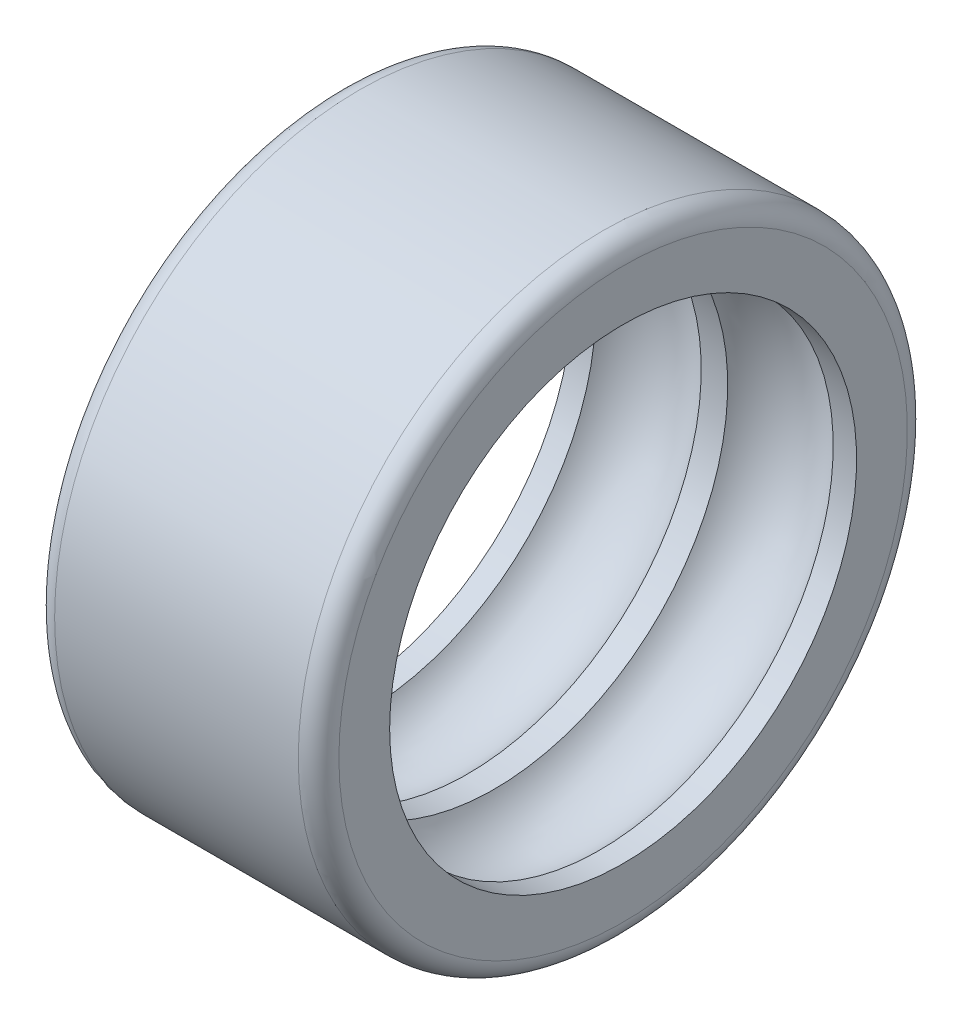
from build123d import *

# Parameters (mm, degrees)
CONG_1_R = 1


with BuildPart() as part:
    # Esquisse1 → Base-R_volution (revolve)
    with BuildSketch(Plane.XY, mode=Mode.PRIVATE) as base_r_volution_sk:
        with BuildLine():
            Line((0, 11.5), (0, 15))
            Line((0, 15), (14, 15))
            Line((14, 15), (14, 11.5))
            Line((14, 11.5), (12.848076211, 11.5))
            ThreePointArc((12.848076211, 11.5), (10.25, 13), (7.651923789, 11.5))
            Line((7.651923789, 11.5), (6.348076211, 11.5))
            ThreePointArc((6.348076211, 11.5), (3.75, 13), (1.151923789, 11.5))
            Line((1.151923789, 11.5), (0, 11.5))
        make_face()
    revolve(base_r_volution_sk.sketch.rotate(Axis((0, 0, 0), (1, 0, 0)), 90), axis=Axis((0, 0, 0), (1, 0, 0)))

    # Cong_1
    cong_1_edges = [part.edges().sort_by_distance(p)[0] for p in [
        (0, 0, -15),
        (14, 0, -15),
    ]]
    fillet(cong_1_edges, radius=CONG_1_R)


solid = part.part
